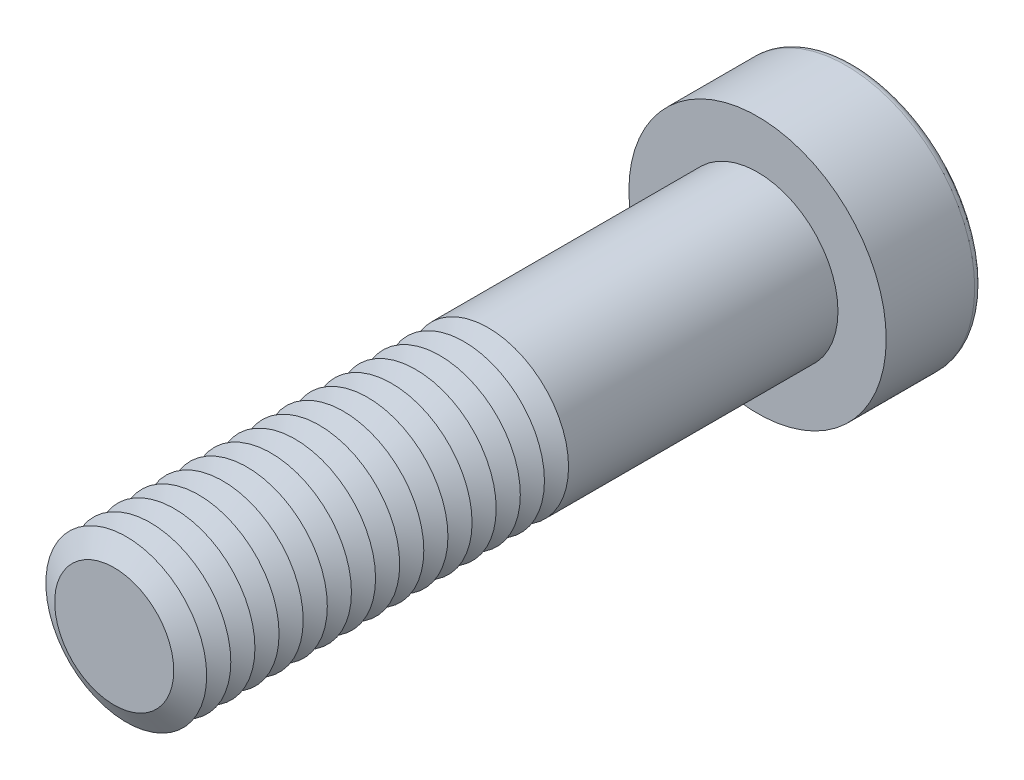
from build123d import *

# Parameters (mm, degrees)
SKETCH1_R           = 5
BOSS_EXTRUDE1_DEPTH = 40
SKETCH2_R           = 8
BOSS_EXTRUDE2_DEPTH = 6
CUT_EXTRUDE1_DEPTH  = 5.25
FILLET1_R           = 0.5
LPATTERN1_COUNT     = 16
LPATTERN1_PITCH     = 1.5


with BuildPart() as part:
    # Sketch1 → Boss-Extrude1 (new body)
    with BuildSketch(Plane.XY):
        Circle(SKETCH1_R)
    extrude(amount=BOSS_EXTRUDE1_DEPTH)

    # Sketch2 → Boss-Extrude2 (add)
    with BuildSketch(Plane(origin=(0, 0, 0), x_dir=(-1, 0, 0), z_dir=(0, 0, -1))):
        Circle(SKETCH2_R)
    extrude(amount=BOSS_EXTRUDE2_DEPTH)

    # Sketch3 → Cut-Extrude1 (cut)
    with BuildSketch(Plane(origin=(0, 0, -6), x_dir=(-1, 0, 0), z_dir=(0, 0, -1))):
        Polygon((-2.020725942, 3.5), (-4.041451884, 0), (-2.020725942, -3.5), (2.020725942, -3.5), (4.041451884, 0), (2.020725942, 3.5), align=None)
    extrude(amount=-CUT_EXTRUDE1_DEPTH, mode=Mode.SUBTRACT)

    # Fillet1
    fillet1_edges = [part.edges().sort_by_distance(p)[0] for p in [
        (8, 0, -6),
    ]]
    fillet(fillet1_edges, radius=FILLET1_R)

    # Cut-Extrude2 cone 1 section (on through the dimple's axis) → Cut-Extrude2 (revolve, cut)
    with BuildSketch(Plane(origin=(0, 0, -0.75), x_dir=(0, 1, 0), z_dir=(1, 0, 0))):
        Polygon((0, 0), (3.5, 0), (0, 2.020725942), align=None)
    revolve(axis=Axis((0, 0, -0.75), (0, 0, 1)), mode=Mode.SUBTRACT)

    # Cut-Extrude3 cone 1 section (on through the dimple's axis) → Cut-Extrude3 (revolve, cut)
    with BuildSketch(Plane(origin=(0, 0, -6), x_dir=(0, 1, 0), z_dir=(1, 0, 0))):
        Polygon((0, 0), (4.041451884, 0), (0, 1.082903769), align=None)
    revolve(axis=Axis((0, 0, -6), (0, 0, 1)), mode=Mode.SUBTRACT)

    # Sketch7 → Cut-Revolve1 (revolve, cut)
    with BuildSketch(Plane(origin=(0, 0, 0), x_dir=(0, 0, -1), z_dir=(1, 0, 0)), mode=Mode.PRIVATE) as cut_revolve1_sk:
        Polygon((-40, 3.700961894), (-39.25, 5), (-40.75, 5), align=None)
    cut_revolve1 = revolve(cut_revolve1_sk.sketch.rotate(Axis((0, 0, 40), (0, 0, -1)), 90), axis=Axis((0, 0, 40), (0, 0, -1)), mode=Mode.SUBTRACT)

    # LPattern1: Cut-Revolve1 ×16
    with Locations(*[(0, 0, -i * LPATTERN1_PITCH) for i in range(1, LPATTERN1_COUNT)]):
        add(cut_revolve1, mode=Mode.SUBTRACT)


solid = part.part
